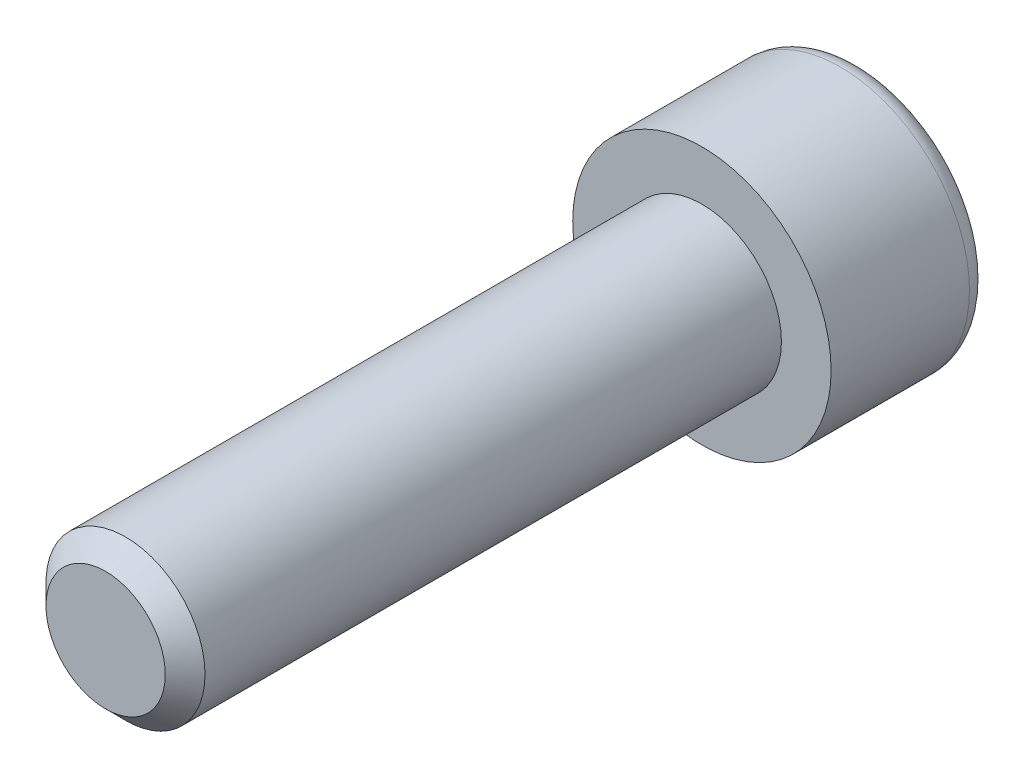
from build123d import *

# Parameters (mm, degrees)
ESQUISSE1_R     = 4
CORPS_DEPTH     = 30
ESQUISSE2_R     = 6.5
TETE_DEPTH      = 8
F_6PANS_DEPTH   = 5.6
CHANFREIN2_SIZE = 1
CONG_1_R        = 1.04


with BuildPart() as part:
    # Esquisse1 → Corps (new body)
    with BuildSketch(Plane.XY):
        Circle(ESQUISSE1_R)
    extrude(amount=CORPS_DEPTH)

    # Esquisse2 → Tete (add)
    with BuildSketch(Plane.XY):
        Circle(ESQUISSE2_R)
    extrude(amount=-TETE_DEPTH)

    # Esquisse3 → 6pans (cut)
    with BuildSketch(Plane.XY.offset(-8)):
        Polygon((0, -3.464101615), (3, -1.732050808), (3, 1.732050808), (0, 3.464101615), (-3, 1.732050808), (-3, -1.732050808), align=None)
    extrude(amount=F_6PANS_DEPTH, mode=Mode.SUBTRACT)

    # Chanfrein2
    chanfrein2_edges = [part.edges().sort_by_distance(p)[0] for p in [
        (-4, 0, 30),
    ]]
    chamfer(chanfrein2_edges, length=CHANFREIN2_SIZE)

    # Cong_1
    cong_1_edges = [part.edges().sort_by_distance(p)[0] for p in [
        (-6.5, 0, -8),
    ]]
    fillet(cong_1_edges, radius=CONG_1_R)


solid = part.part
